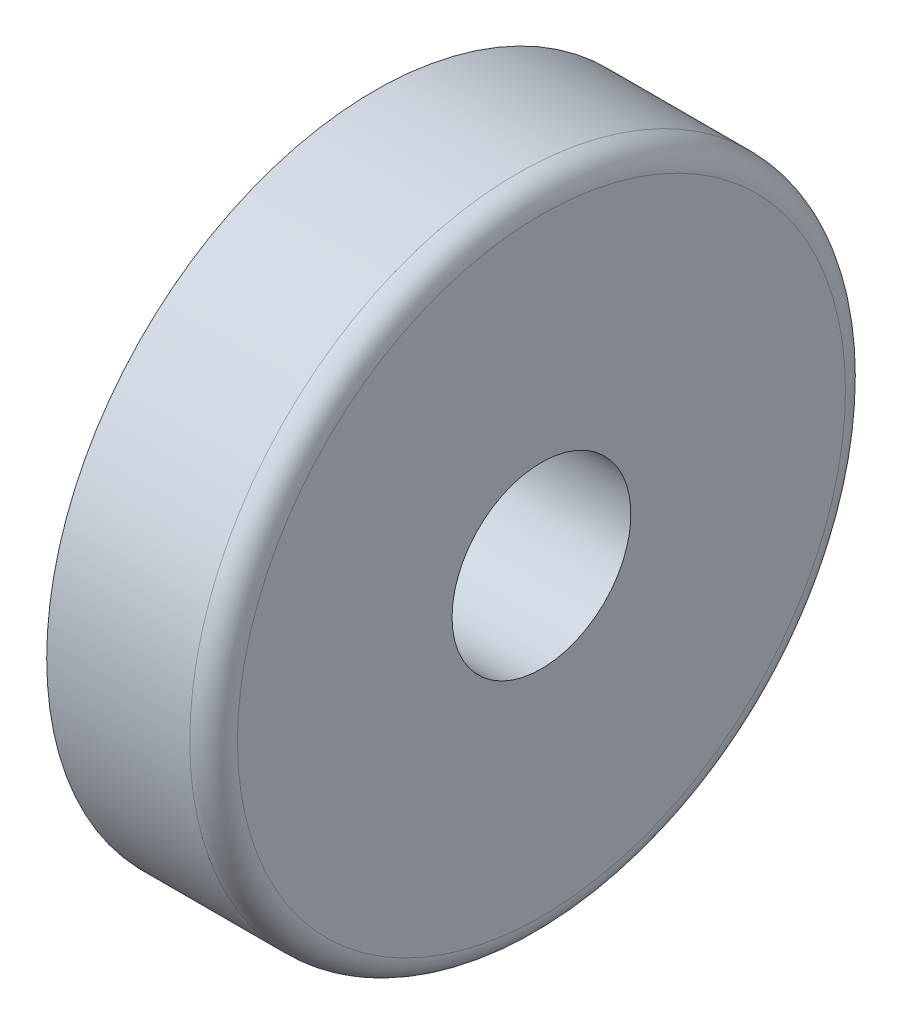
from build123d import *


with BuildPart() as part:
    # Croquis1 → Revoluci_n1 (revolve)
    with BuildSketch(Plane(origin=(0, 0, 0), x_dir=(1, 0, 0), z_dir=(0, 1, 0)), mode=Mode.PRIVATE) as revoluci_n1_sk:
        with BuildLine():
            Line((-2.8, 3), (2.8, 3))
            Line((2.8, 3), (2.8, 10.2))
            ThreePointArc((2.8, 10.2), (2.565685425, 10.765685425), (2, 11))
            Line((2, 11), (-2.8, 11))
            Line((-2.8, 11), (-2.8, 3))
        make_face()
    revolve(revoluci_n1_sk.sketch.rotate(Axis((-6.562533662, 0, 0), (1, 0, 0)), 180), axis=Axis((-6.562533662, 0, 0), (1, 0, 0)))


solid = part.part
